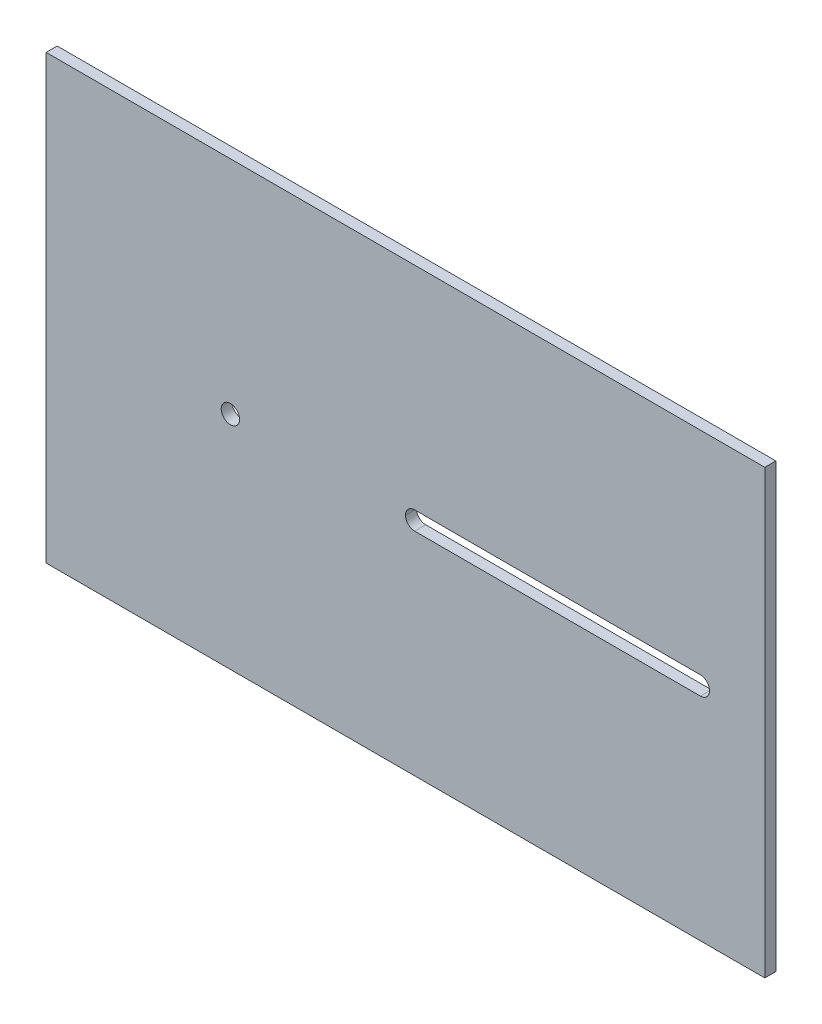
from build123d import *

# Parameters (mm, degrees)
ESQUISSE1_W             = 195
ESQUISSE1_H             = 120
EXTRUSION1_DEPTH        = 3
ESQUISSE2_R             = 2.5
ENL_V_MAT_EXTRU_1_DEPTH = 138.903574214


with BuildPart() as part:
    # Esquisse1 → Extrusion1 (new body)
    with BuildSketch(Plane.XY):
        with Locations((21.725497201, -9.236382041)):
            Rectangle(ESQUISSE1_W, ESQUISSE1_H)
    extrude(amount=EXTRUSION1_DEPTH)

    # Esquisse2 → Enl_v. mat.-Extru.1 (cut, through all)
    with BuildSketch(Plane.XY.offset(3)):
        with Locations((-25.774502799, -9.236382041)):
            Circle(ESQUISSE2_R)
        with BuildLine():
            Line((24.215497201, -6.736382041), (101.735497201, -6.736382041))
            ThreePointArc((101.735497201, -6.736382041), (103.496193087, -7.465686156), (104.225497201, -9.226382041))
            Line((104.225497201, -9.226382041), (104.225497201, -9.246382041))
            ThreePointArc((104.225497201, -9.246382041), (103.496193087, -11.007077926), (101.735497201, -11.736382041))
            Line((101.735497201, -11.736382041), (24.215497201, -11.736382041))
            ThreePointArc((24.215497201, -11.736382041), (22.454801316, -11.007077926), (21.725497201, -9.246382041))
            Line((21.725497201, -9.246382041), (21.725497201, -9.226382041))
            ThreePointArc((21.725497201, -9.226382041), (22.454801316, -7.465686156), (24.215497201, -6.736382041))
        make_face()
    extrude(amount=-ENL_V_MAT_EXTRU_1_DEPTH, mode=Mode.SUBTRACT)


solid = part.part
